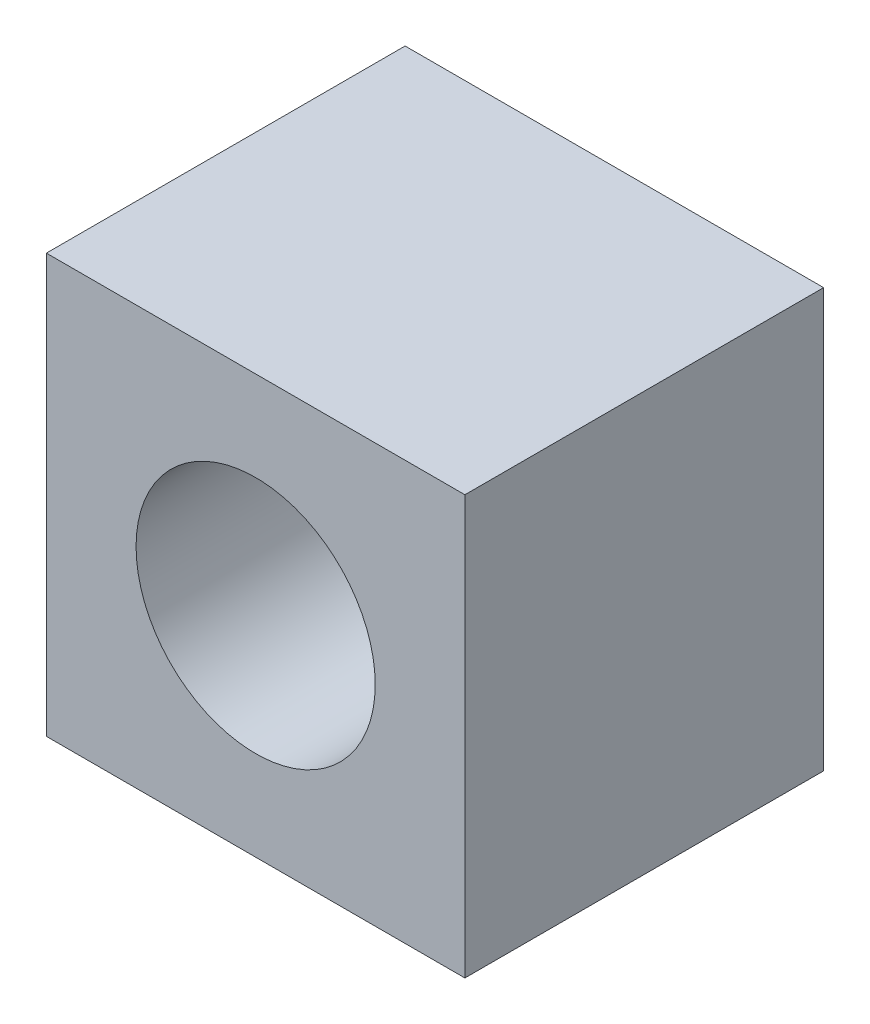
ISO-10303-21;
HEADER;
FILE_DESCRIPTION(('STEP AP214'),'2;1');
FILE_NAME('part.step','',(''),(''),'','','');
FILE_SCHEMA(('AUTOMOTIVE_DESIGN { 1 0 10303 214 1 1 1 1 }'));
ENDSEC;
DATA;
#1=APPLICATION_CONTEXT('core data for automotive mechanical design processes');
#2=APPLICATION_PROTOCOL_DEFINITION('international standard','automotive_design',2000,#1);
#3=PRODUCT_CONTEXT('',#1,'mechanical');
#4=PRODUCT('Part','Part','',(#3));
#5=PRODUCT_RELATED_PRODUCT_CATEGORY('part','',(#4));
#6=PRODUCT_DEFINITION_FORMATION('','',#4);
#7=PRODUCT_DEFINITION_CONTEXT('part definition',#1,'design');
#8=PRODUCT_DEFINITION('design','',#6,#7);
#9=PRODUCT_DEFINITION_SHAPE('','',#8);
#10=(LENGTH_UNIT() NAMED_UNIT(*) SI_UNIT(.MILLI.,.METRE.));
#11=(NAMED_UNIT(*) PLANE_ANGLE_UNIT() SI_UNIT($,.RADIAN.));
#12=(NAMED_UNIT(*) SI_UNIT($,.STERADIAN.) SOLID_ANGLE_UNIT());
#13=UNCERTAINTY_MEASURE_WITH_UNIT(LENGTH_MEASURE(1.E-05),#10,'distance_accuracy_value','');
#14=(GEOMETRIC_REPRESENTATION_CONTEXT(3) GLOBAL_UNCERTAINTY_ASSIGNED_CONTEXT((#13)) GLOBAL_UNIT_ASSIGNED_CONTEXT((#10,
#11,#12)) REPRESENTATION_CONTEXT('',''));
#15=CARTESIAN_POINT('',(0.,0.,0.));
#16=DIRECTION('',(0.,0.,1.));
#17=DIRECTION('',(1.,0.,0.));
#18=AXIS2_PLACEMENT_3D('',#15,#16,#17);
#19=CARTESIAN_POINT('',(0.,0.,19.0499999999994));
#20=DIRECTION('',(0.,0.,0.999999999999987));
#21=DIRECTION('',(1.,0.,0.));
#22=AXIS2_PLACEMENT_3D('',#19,#20,#21);
#23=PLANE('',#22);
#24=DIRECTION('',(-0.999999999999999,0.,0.));
#25=VECTOR('',#24,1.);
#26=CARTESIAN_POINT('',(-11.1125000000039,11.1125000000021,19.0499999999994));
#27=LINE('',#26,#25);
#28=CARTESIAN_POINT('',(11.1124999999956,11.1125000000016,19.0499999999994));
#29=VERTEX_POINT('',#28);
#30=CARTESIAN_POINT('',(-11.1125000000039,11.1125000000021,19.0499999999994));
#31=VERTEX_POINT('',#30);
#32=EDGE_CURVE('E94',#29,#31,#27,.T.);
#33=ORIENTED_EDGE('',*,*,#32,.T.);
#34=DIRECTION('',(0.,-1.,0.));
#35=VECTOR('',#34,1.);
#36=CARTESIAN_POINT('',(-11.1124999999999,-11.1124999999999,19.0499999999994));
#37=LINE('',#36,#35);
#38=CARTESIAN_POINT('',(-11.1124999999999,-11.1124999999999,19.0499999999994));
#39=VERTEX_POINT('',#38);
#40=EDGE_CURVE('E89',#31,#39,#37,.T.);
#41=ORIENTED_EDGE('',*,*,#40,.T.);
#42=DIRECTION('',(0.999999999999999,0.,0.));
#43=VECTOR('',#42,1.);
#44=CARTESIAN_POINT('',(-11.1124999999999,-11.1124999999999,19.0499999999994));
#45=LINE('',#44,#43);
#46=CARTESIAN_POINT('',(11.1124999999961,-11.1124999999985,19.0499999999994));
#47=VERTEX_POINT('',#46);
#48=EDGE_CURVE('E92',#39,#47,#45,.T.);
#49=ORIENTED_EDGE('',*,*,#48,.T.);
#50=DIRECTION('',(0.,1.,0.));
#51=VECTOR('',#50,1.);
#52=CARTESIAN_POINT('',(11.1124999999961,-11.1124999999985,19.0499999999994));
#53=LINE('',#52,#51);
#54=EDGE_CURVE('E59',#47,#29,#53,.T.);
#55=ORIENTED_EDGE('',*,*,#54,.T.);
#56=EDGE_LOOP('',(#33,#41,#49,#55));
#57=FACE_BOUND('',#56,.T.);
#58=CARTESIAN_POINT('',(0.,0.,19.0499999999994));
#59=DIRECTION('',(0.,0.,0.999999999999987));
#60=DIRECTION('',(1.,0.,0.));
#61=AXIS2_PLACEMENT_3D('',#58,#59,#60);
#62=CIRCLE('',#61,6.35);
#63=CARTESIAN_POINT('',(-6.35,0.,19.0499999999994));
#64=VERTEX_POINT('',#63);
#65=EDGE_CURVE('E114',#64,#64,#62,.T.);
#66=ORIENTED_EDGE('',*,*,#65,.F.);
#67=EDGE_LOOP('',(#66));
#68=FACE_BOUND('',#67,.T.);
#69=ADVANCED_FACE('F41',(#57,#68),#23,.T.);
#70=CARTESIAN_POINT('',(0.,0.,0.));
#71=DIRECTION('',(0.,0.,0.999999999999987));
#72=DIRECTION('',(1.,0.,0.));
#73=AXIS2_PLACEMENT_3D('',#70,#71,#72);
#74=PLANE('',#73);
#75=DIRECTION('',(-0.999999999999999,0.,0.));
#76=VECTOR('',#75,1.);
#77=CARTESIAN_POINT('',(-11.1125000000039,11.1125000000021,0.));
#78=LINE('',#77,#76);
#79=CARTESIAN_POINT('',(11.1124999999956,11.1125000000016,0.));
#80=VERTEX_POINT('',#79);
#81=CARTESIAN_POINT('',(-11.1125000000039,11.1125000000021,0.));
#82=VERTEX_POINT('',#81);
#83=EDGE_CURVE('E110',#80,#82,#78,.T.);
#84=ORIENTED_EDGE('',*,*,#83,.F.);
#85=DIRECTION('',(0.,1.,0.));
#86=VECTOR('',#85,1.);
#87=CARTESIAN_POINT('',(11.1124999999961,-11.1124999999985,0.));
#88=LINE('',#87,#86);
#89=CARTESIAN_POINT('',(11.1124999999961,-11.1124999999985,0.));
#90=VERTEX_POINT('',#89);
#91=EDGE_CURVE('E82',#90,#80,#88,.T.);
#92=ORIENTED_EDGE('',*,*,#91,.F.);
#93=DIRECTION('',(0.999999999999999,0.,0.));
#94=VECTOR('',#93,1.);
#95=CARTESIAN_POINT('',(-11.1124999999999,-11.1124999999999,0.));
#96=LINE('',#95,#94);
#97=CARTESIAN_POINT('',(-11.1124999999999,-11.1124999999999,0.));
#98=VERTEX_POINT('',#97);
#99=EDGE_CURVE('E76',#98,#90,#96,.T.);
#100=ORIENTED_EDGE('',*,*,#99,.F.);
#101=DIRECTION('',(0.,-1.,0.));
#102=VECTOR('',#101,1.);
#103=CARTESIAN_POINT('',(-11.1124999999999,-11.1124999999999,0.));
#104=LINE('',#103,#102);
#105=EDGE_CURVE('E99',#82,#98,#104,.T.);
#106=ORIENTED_EDGE('',*,*,#105,.F.);
#107=EDGE_LOOP('',(#84,#92,#100,#106));
#108=FACE_BOUND('',#107,.T.);
#109=CARTESIAN_POINT('',(0.,0.,0.));
#110=DIRECTION('',(0.,0.,0.999999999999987));
#111=DIRECTION('',(1.,0.,0.));
#112=AXIS2_PLACEMENT_3D('',#109,#110,#111);
#113=CIRCLE('',#112,6.35);
#114=CARTESIAN_POINT('',(-6.35,0.,0.));
#115=VERTEX_POINT('',#114);
#116=EDGE_CURVE('E132',#115,#115,#113,.T.);
#117=ORIENTED_EDGE('',*,*,#116,.T.);
#118=EDGE_LOOP('',(#117));
#119=FACE_BOUND('',#118,.T.);
#120=ADVANCED_FACE('F127',(#108,#119),#74,.F.);
#121=CARTESIAN_POINT('',(-11.1125000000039,11.1125000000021,19.0499999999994));
#122=DIRECTION('',(0.,-0.999999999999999,0.));
#123=DIRECTION('',(0.999999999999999,0.,0.));
#124=AXIS2_PLACEMENT_3D('',#121,#122,#123);
#125=PLANE('',#124);
#126=ORIENTED_EDGE('',*,*,#83,.T.);
#127=DIRECTION('',(0.,0.,-0.999999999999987));
#128=VECTOR('',#127,1.);
#129=CARTESIAN_POINT('',(-11.1125000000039,11.1125000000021,19.0499999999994));
#130=LINE('',#129,#128);
#131=EDGE_CURVE('E11',#31,#82,#130,.T.);
#132=ORIENTED_EDGE('',*,*,#131,.F.);
#133=ORIENTED_EDGE('',*,*,#32,.F.);
#134=DIRECTION('',(0.,0.,-0.999999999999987));
#135=VECTOR('',#134,1.);
#136=CARTESIAN_POINT('',(11.1124999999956,11.1125000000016,19.0499999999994));
#137=LINE('',#136,#135);
#138=EDGE_CURVE('E106',#29,#80,#137,.T.);
#139=ORIENTED_EDGE('',*,*,#138,.T.);
#140=EDGE_LOOP('',(#126,#132,#133,#139));
#141=FACE_BOUND('',#140,.T.);
#142=ADVANCED_FACE('F43',(#141),#125,.F.);
#143=CARTESIAN_POINT('',(-11.1124999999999,-11.1124999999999,19.0499999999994));
#144=DIRECTION('',(0.999999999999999,0.,0.));
#145=DIRECTION('',(0.,0.,-0.999999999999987));
#146=AXIS2_PLACEMENT_3D('',#143,#144,#145);
#147=PLANE('',#146);
#148=ORIENTED_EDGE('',*,*,#105,.T.);
#149=DIRECTION('',(0.,0.,-0.999999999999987));
#150=VECTOR('',#149,1.);
#151=CARTESIAN_POINT('',(-11.1124999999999,-11.1124999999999,19.0499999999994));
#152=LINE('',#151,#150);
#153=EDGE_CURVE('E51',#39,#98,#152,.T.);
#154=ORIENTED_EDGE('',*,*,#153,.F.);
#155=ORIENTED_EDGE('',*,*,#40,.F.);
#156=ORIENTED_EDGE('',*,*,#131,.T.);
#157=EDGE_LOOP('',(#148,#154,#155,#156));
#158=FACE_BOUND('',#157,.T.);
#159=ADVANCED_FACE('F98',(#158),#147,.F.);
#160=CARTESIAN_POINT('',(-11.1124999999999,-11.1124999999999,19.0499999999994));
#161=DIRECTION('',(0.,0.999999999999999,0.));
#162=DIRECTION('',(-0.999999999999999,0.,0.));
#163=AXIS2_PLACEMENT_3D('',#160,#161,#162);
#164=PLANE('',#163);
#165=ORIENTED_EDGE('',*,*,#99,.T.);
#166=DIRECTION('',(0.,0.,-0.999999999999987));
#167=VECTOR('',#166,1.);
#168=CARTESIAN_POINT('',(11.1124999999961,-11.1124999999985,19.0499999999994));
#169=LINE('',#168,#167);
#170=EDGE_CURVE('E101',#47,#90,#169,.T.);
#171=ORIENTED_EDGE('',*,*,#170,.F.);
#172=ORIENTED_EDGE('',*,*,#48,.F.);
#173=ORIENTED_EDGE('',*,*,#153,.T.);
#174=EDGE_LOOP('',(#165,#171,#172,#173));
#175=FACE_BOUND('',#174,.T.);
#176=ADVANCED_FACE('F102',(#175),#164,.F.);
#177=CARTESIAN_POINT('',(11.1124999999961,-11.1124999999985,19.0499999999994));
#178=DIRECTION('',(-0.999999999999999,0.,0.));
#179=DIRECTION('',(0.,0.,0.999999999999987));
#180=AXIS2_PLACEMENT_3D('',#177,#178,#179);
#181=PLANE('',#180);
#182=ORIENTED_EDGE('',*,*,#91,.T.);
#183=ORIENTED_EDGE('',*,*,#138,.F.);
#184=ORIENTED_EDGE('',*,*,#54,.F.);
#185=ORIENTED_EDGE('',*,*,#170,.T.);
#186=EDGE_LOOP('',(#182,#183,#184,#185));
#187=FACE_BOUND('',#186,.T.);
#188=ADVANCED_FACE('F124',(#187),#181,.F.);
#189=CARTESIAN_POINT('',(0.,0.,19.0499999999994));
#190=DIRECTION('',(0.,0.,-0.999999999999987));
#191=DIRECTION('',(-1.,0.,0.));
#192=AXIS2_PLACEMENT_3D('',#189,#190,#191);
#193=CYLINDRICAL_SURFACE('',#192,6.35);
#194=CARTESIAN_POINT('',(-6.35,0.,19.0499999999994));
#195=CARTESIAN_POINT('',(-6.35,0.,18.8515624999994));
#196=CARTESIAN_POINT('',(-6.35,0.,18.6531249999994));
#197=CARTESIAN_POINT('',(-6.35,0.,18.2562499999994));
#198=CARTESIAN_POINT('',(-6.35,0.,18.0578124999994));
#199=CARTESIAN_POINT('',(-6.35,0.,17.6609374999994));
#200=CARTESIAN_POINT('',(-6.35,0.,17.4624999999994));
#201=CARTESIAN_POINT('',(-6.35,0.,17.0656249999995));
#202=CARTESIAN_POINT('',(-6.35,0.,16.8671874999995));
#203=CARTESIAN_POINT('',(-6.35,0.,16.4703124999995));
#204=CARTESIAN_POINT('',(-6.35,0.,16.2718749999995));
#205=CARTESIAN_POINT('',(-6.35,0.,15.8749999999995));
#206=CARTESIAN_POINT('',(-6.35,0.,15.6765624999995));
#207=CARTESIAN_POINT('',(-6.35,0.,15.2796874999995));
#208=CARTESIAN_POINT('',(-6.35,0.,15.0812499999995));
#209=CARTESIAN_POINT('',(-6.35,0.,14.6843749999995));
#210=CARTESIAN_POINT('',(-6.35,0.,14.4859374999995));
#211=CARTESIAN_POINT('',(-6.35,0.,14.0890624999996));
#212=CARTESIAN_POINT('',(-6.35,0.,13.8906249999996));
#213=CARTESIAN_POINT('',(-6.35,0.,13.4937499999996));
#214=CARTESIAN_POINT('',(-6.35,0.,13.2953124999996));
#215=CARTESIAN_POINT('',(-6.35,0.,12.8984374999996));
#216=CARTESIAN_POINT('',(-6.35,0.,12.6999999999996));
#217=CARTESIAN_POINT('',(-6.35,0.,12.3031249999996));
#218=CARTESIAN_POINT('',(-6.35,0.,12.1046874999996));
#219=CARTESIAN_POINT('',(-6.35,0.,11.7078124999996));
#220=CARTESIAN_POINT('',(-6.35,0.,11.5093749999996));
#221=CARTESIAN_POINT('',(-6.35,0.,11.1124999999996));
#222=CARTESIAN_POINT('',(-6.35,0.,10.9140624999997));
#223=CARTESIAN_POINT('',(-6.35,0.,10.5171874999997));
#224=CARTESIAN_POINT('',(-6.35,0.,10.3187499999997));
#225=CARTESIAN_POINT('',(-6.35,0.,9.92187499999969));
#226=CARTESIAN_POINT('',(-6.35,0.,9.72343749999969));
#227=CARTESIAN_POINT('',(-6.35,0.,9.3265624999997));
#228=CARTESIAN_POINT('',(-6.35,0.,9.12812499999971));
#229=CARTESIAN_POINT('',(-6.35,0.,8.73124999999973));
#230=CARTESIAN_POINT('',(-6.35,0.,8.53281249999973));
#231=CARTESIAN_POINT('',(-6.35,0.,8.13593749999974));
#232=CARTESIAN_POINT('',(-6.35,0.,7.93749999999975));
#233=CARTESIAN_POINT('',(-6.35,0.,7.54062499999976));
#234=CARTESIAN_POINT('',(-6.35,0.,7.34218749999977));
#235=CARTESIAN_POINT('',(-6.35,0.,6.94531249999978));
#236=CARTESIAN_POINT('',(-6.35,0.,6.74687499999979));
#237=CARTESIAN_POINT('',(-6.35,0.,6.3499999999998));
#238=CARTESIAN_POINT('',(-6.35,0.,6.15156249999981));
#239=CARTESIAN_POINT('',(-6.35,0.,5.75468749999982));
#240=CARTESIAN_POINT('',(-6.35,0.,5.55624999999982));
#241=CARTESIAN_POINT('',(-6.35,0.,5.15937499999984));
#242=CARTESIAN_POINT('',(-6.35,0.,4.96093749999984));
#243=CARTESIAN_POINT('',(-6.35,0.,4.56406249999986));
#244=CARTESIAN_POINT('',(-6.35,0.,4.36562499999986));
#245=CARTESIAN_POINT('',(-6.35,0.,3.96874999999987));
#246=CARTESIAN_POINT('',(-6.35,0.,3.77031249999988));
#247=CARTESIAN_POINT('',(-6.35,0.,3.37343749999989));
#248=CARTESIAN_POINT('',(-6.35,0.,3.1749999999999));
#249=CARTESIAN_POINT('',(-6.35,0.,2.77812499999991));
#250=CARTESIAN_POINT('',(-6.35,0.,2.57968749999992));
#251=CARTESIAN_POINT('',(-6.35,0.,2.18281249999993));
#252=CARTESIAN_POINT('',(-6.35,0.,1.98437499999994));
#253=CARTESIAN_POINT('',(-6.35,0.,1.58749999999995));
#254=CARTESIAN_POINT('',(-6.35,0.,1.38906249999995));
#255=CARTESIAN_POINT('',(-6.35,0.,0.992187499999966));
#256=CARTESIAN_POINT('',(-6.35,0.,0.793749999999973));
#257=CARTESIAN_POINT('',(-6.35,0.,0.396874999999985));
#258=CARTESIAN_POINT('',(-6.35,0.,0.198437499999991));
#259=CARTESIAN_POINT('',(-6.35,0.,0.));
#260=B_SPLINE_CURVE_WITH_KNOTS('',3,(#194,#195,#196,#197,#198,#199,#200,#201,#202,#203,#204,
#205,#206,#207,#208,#209,#210,#211,#212,#213,#214,#215,#216,#217,#218,#219,#220,#221,#222,#223,
#224,#225,#226,#227,#228,#229,#230,#231,#232,#233,#234,#235,#236,#237,#238,#239,#240,#241,#242,
#243,#244,#245,#246,#247,#248,#249,#250,#251,#252,#253,#254,#255,#256,#257,#258,#259),
.UNSPECIFIED.,.F.,.F.,(4,2,2,2,2,2,2,2,2,2,2,2,2,2,2,2,2,2,2,2,2,2,2,2,2,2,2,2,2,2,2,2,4),(0.,
0.595312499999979,1.19062499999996,1.78593749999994,2.38124999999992,2.9765624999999,
3.57187499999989,4.16718749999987,4.76249999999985,5.35781249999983,5.95312499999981,
6.54843749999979,7.14374999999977,7.73906249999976,8.33437499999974,8.92968749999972,
9.5249999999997,10.1203124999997,10.7156249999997,11.3109374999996,11.9062499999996,
12.5015624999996,13.0968749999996,13.6921874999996,14.2874999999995,14.8828124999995,
15.4781249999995,16.0734374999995,16.6687499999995,17.2640624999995,17.8593749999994,
18.4546874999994,19.0499999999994),.UNSPECIFIED.);
#261=EDGE_CURVE('BSEAM140',#64,#115,#260,.T.);
#262=ORIENTED_EDGE('',*,*,#65,.T.);
#263=ORIENTED_EDGE('',*,*,#116,.F.);
#264=ORIENTED_EDGE('',*,*,#261,.T.);
#265=ORIENTED_EDGE('',*,*,#261,.F.);
#266=EDGE_LOOP('',(#262,#264,#263,#265));
#267=FACE_BOUND('',#266,.T.);
#268=ADVANCED_FACE('F140',(#267),#193,.F.);
#269=CLOSED_SHELL('',(#69,#120,#142,#159,#176,#188,#268));
#270=MANIFOLD_SOLID_BREP('B2',#269);
#271=ADVANCED_BREP_SHAPE_REPRESENTATION('',(#18,#270),#14);
#272=SHAPE_DEFINITION_REPRESENTATION(#9,#271);
ENDSEC;
END-ISO-10303-21;
